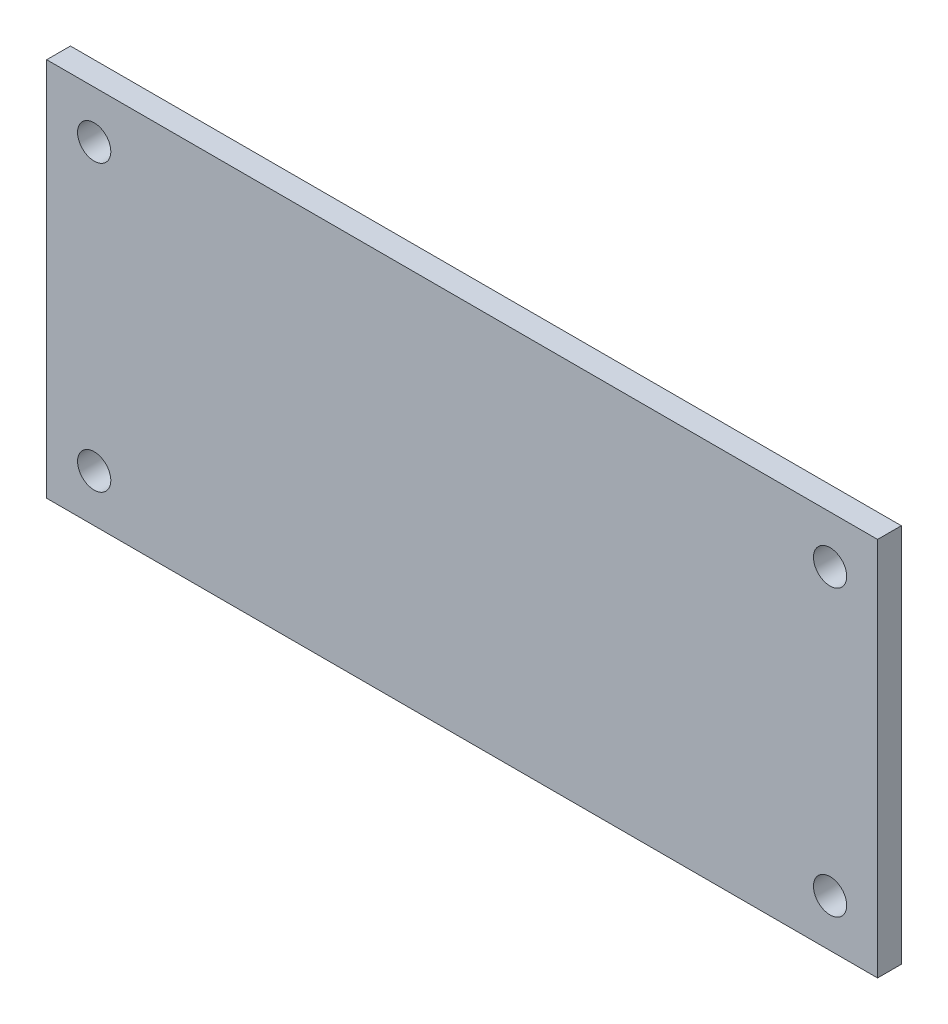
from build123d import *

# Parameters (mm, degrees)
ESQUISSE1_W      = 350
ESQUISSE1_H      = 160
ESQUISSE1_R      = 7
EXTRUSION1_DEPTH = 10


with BuildPart() as part:
    # Esquisse1 → Extrusion1 (new body)
    with BuildSketch(Plane.XY):
        with Locations((0, -35)):
            Rectangle(ESQUISSE1_W, ESQUISSE1_H)
        with Locations((-155, 25)):
            Circle(ESQUISSE1_R, mode=Mode.SUBTRACT)
        with Locations((-155, -95)):
            Circle(ESQUISSE1_R, mode=Mode.SUBTRACT)
        with Locations((155, -95)):
            Circle(ESQUISSE1_R, mode=Mode.SUBTRACT)
        with Locations((155, 25)):
            Circle(ESQUISSE1_R, mode=Mode.SUBTRACT)
    extrude(amount=EXTRUSION1_DEPTH)


solid = part.part
